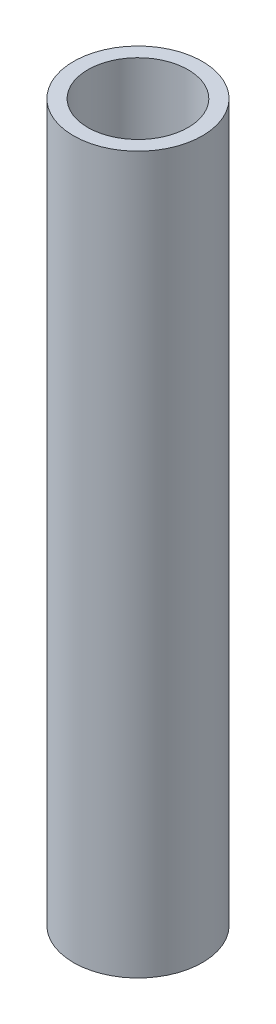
from build123d import *

# Parameters (mm, degrees)
SKETCH1_R           = 4.5
SKETCH1_R_2         = 3.5
BOSS_EXTRUDE1_DEPTH = 50


with BuildPart() as part:
    # Sketch1 → Boss-Extrude1 (new body)
    with BuildSketch(Plane(origin=(0, 0, 0), x_dir=(1, 0, 0), z_dir=(0, 1, 0))):
        with Locations(Location((0, 0, 0), (0, 0, 270))):
            Circle(SKETCH1_R)
        with Locations(Location((0, 0, 0), (0, 0, 270))):
            Circle(SKETCH1_R_2, mode=Mode.SUBTRACT)
    extrude(amount=BOSS_EXTRUDE1_DEPTH)


solid = part.part
